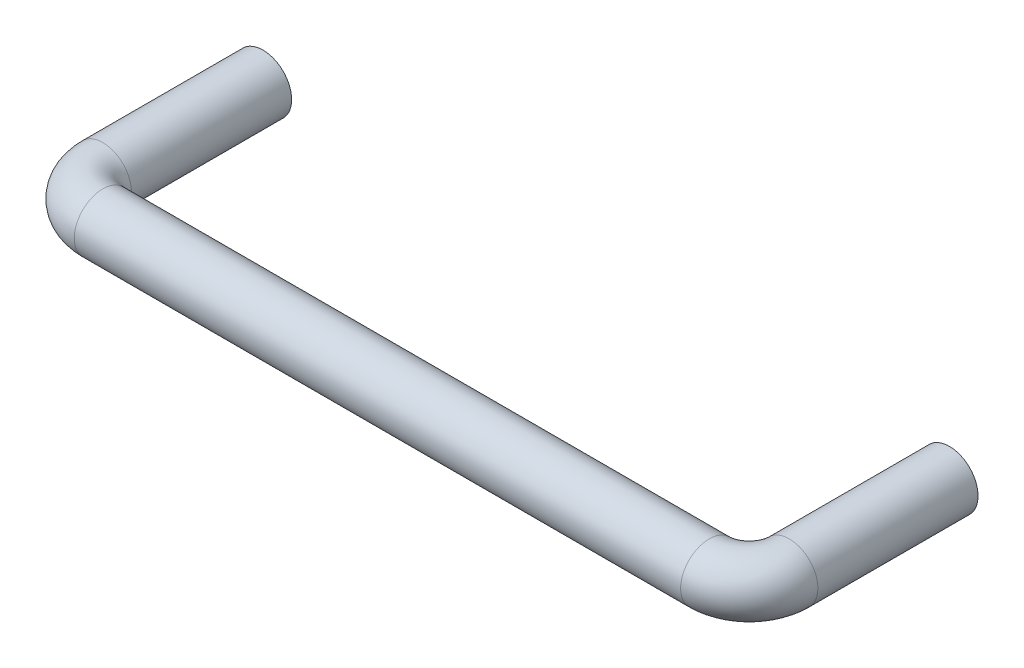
ISO-10303-21;
HEADER;
FILE_DESCRIPTION(('STEP AP214'),'2;1');
FILE_NAME('part.step','',(''),(''),'','','');
FILE_SCHEMA(('AUTOMOTIVE_DESIGN { 1 0 10303 214 1 1 1 1 }'));
ENDSEC;
DATA;
#1=APPLICATION_CONTEXT('core data for automotive mechanical design processes');
#2=APPLICATION_PROTOCOL_DEFINITION('international standard','automotive_design',2000,#1);
#3=PRODUCT_CONTEXT('',#1,'mechanical');
#4=PRODUCT('Part','Part','',(#3));
#5=PRODUCT_RELATED_PRODUCT_CATEGORY('part','',(#4));
#6=PRODUCT_DEFINITION_FORMATION('','',#4);
#7=PRODUCT_DEFINITION_CONTEXT('part definition',#1,'design');
#8=PRODUCT_DEFINITION('design','',#6,#7);
#9=PRODUCT_DEFINITION_SHAPE('','',#8);
#10=(LENGTH_UNIT() NAMED_UNIT(*) SI_UNIT(.MILLI.,.METRE.));
#11=(NAMED_UNIT(*) PLANE_ANGLE_UNIT() SI_UNIT($,.RADIAN.));
#12=(NAMED_UNIT(*) SI_UNIT($,.STERADIAN.) SOLID_ANGLE_UNIT());
#13=UNCERTAINTY_MEASURE_WITH_UNIT(LENGTH_MEASURE(1.E-05),#10,'distance_accuracy_value','');
#14=(GEOMETRIC_REPRESENTATION_CONTEXT(3) GLOBAL_UNCERTAINTY_ASSIGNED_CONTEXT((#13)) GLOBAL_UNIT_ASSIGNED_CONTEXT((#10,
#11,#12)) REPRESENTATION_CONTEXT('',''));
#15=CARTESIAN_POINT('',(0.,0.,0.));
#16=DIRECTION('',(0.,0.,1.));
#17=DIRECTION('',(1.,0.,0.));
#18=AXIS2_PLACEMENT_3D('',#15,#16,#17);
#19=CARTESIAN_POINT('',(0.,0.,0.));
#20=DIRECTION('',(0.,0.,1.));
#21=DIRECTION('',(1.,0.,0.));
#22=AXIS2_PLACEMENT_3D('',#19,#20,#21);
#23=PLANE('',#22);
#24=CARTESIAN_POINT('',(0.,0.,0.));
#25=DIRECTION('',(0.,0.,1.));
#26=DIRECTION('',(1.,0.,0.));
#27=AXIS2_PLACEMENT_3D('',#24,#25,#26);
#28=CIRCLE('',#27,2.95);
#29=CARTESIAN_POINT('',(2.95,0.,0.));
#30=VERTEX_POINT('',#29);
#31=EDGE_CURVE('E23',#30,#30,#28,.T.);
#32=ORIENTED_EDGE('',*,*,#31,.T.);
#33=EDGE_LOOP('',(#32));
#34=FACE_BOUND('',#33,.T.);
#35=CARTESIAN_POINT('',(0.,0.,0.));
#36=DIRECTION('',(0.,0.,1.));
#37=DIRECTION('',(1.,0.,0.));
#38=AXIS2_PLACEMENT_3D('',#35,#36,#37);
#39=CIRCLE('',#38,5.);
#40=CARTESIAN_POINT('',(5.,0.,0.));
#41=VERTEX_POINT('',#40);
#42=EDGE_CURVE('E32',#41,#41,#39,.T.);
#43=ORIENTED_EDGE('',*,*,#42,.F.);
#44=EDGE_LOOP('',(#43));
#45=FACE_BOUND('',#44,.T.);
#46=ADVANCED_FACE('F12',(#34,#45),#23,.F.);
#47=CARTESIAN_POINT('',(120.,0.,1.94289029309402E-13));
#48=DIRECTION('',(0.,0.,-1.));
#49=DIRECTION('',(-1.,0.,0.));
#50=AXIS2_PLACEMENT_3D('',#47,#48,#49);
#51=PLANE('',#50);
#52=CARTESIAN_POINT('',(120.,0.,1.94289029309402E-13));
#53=DIRECTION('',(0.,0.,-1.));
#54=DIRECTION('',(-1.,0.,0.));
#55=AXIS2_PLACEMENT_3D('',#52,#53,#54);
#56=CIRCLE('',#55,2.95000000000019);
#57=CARTESIAN_POINT('',(117.05,0.,1.97213277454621E-13));
#58=VERTEX_POINT('',#57);
#59=EDGE_CURVE('E8',#58,#58,#56,.F.);
#60=ORIENTED_EDGE('',*,*,#59,.T.);
#61=EDGE_LOOP('',(#60));
#62=FACE_BOUND('',#61,.T.);
#63=CARTESIAN_POINT('',(120.,0.,1.94289029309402E-13));
#64=DIRECTION('',(0.,0.,-1.));
#65=DIRECTION('',(-1.,0.,0.));
#66=AXIS2_PLACEMENT_3D('',#63,#64,#65);
#67=CIRCLE('',#66,5.);
#68=CARTESIAN_POINT('',(115.,0.,1.99245382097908E-13));
#69=VERTEX_POINT('',#68);
#70=EDGE_CURVE('E47',#69,#69,#67,.T.);
#71=ORIENTED_EDGE('',*,*,#70,.T.);
#72=EDGE_LOOP('',(#71));
#73=FACE_BOUND('',#72,.T.);
#74=ADVANCED_FACE('F76',(#62,#73),#51,.T.);
#75=CARTESIAN_POINT('',(0.,0.,27.9999999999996));
#76=DIRECTION('',(0.,0.,-1.));
#77=DIRECTION('',(0.,-1.,0.));
#78=AXIS2_PLACEMENT_3D('',#75,#76,#77);
#79=CYLINDRICAL_SURFACE('',#78,5.);
#80=ORIENTED_EDGE('',*,*,#42,.T.);
#81=EDGE_LOOP('',(#80));
#82=FACE_BOUND('',#81,.T.);
#83=CARTESIAN_POINT('',(0.,0.,27.9999999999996));
#84=DIRECTION('',(0.,0.,1.));
#85=DIRECTION('',(1.,0.,0.));
#86=AXIS2_PLACEMENT_3D('',#83,#84,#85);
#87=CIRCLE('',#86,5.);
#88=CARTESIAN_POINT('',(-5.,0.,27.9999999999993));
#89=VERTEX_POINT('',#88);
#90=EDGE_CURVE('E35',#89,#89,#87,.T.);
#91=ORIENTED_EDGE('',*,*,#90,.F.);
#92=EDGE_LOOP('',(#91));
#93=FACE_BOUND('',#92,.T.);
#94=ADVANCED_FACE('F83',(#82,#93),#79,.T.);
#95=CARTESIAN_POINT('',(7.,0.,28.));
#96=DIRECTION('',(0.,-1.,0.));
#97=DIRECTION('',(1.,0.,0.));
#98=AXIS2_PLACEMENT_3D('',#95,#96,#97);
#99=TOROIDAL_SURFACE('',#98,7.,5.);
#100=CARTESIAN_POINT('',(7.,0.,35.));
#101=DIRECTION('',(1.,0.,0.));
#102=DIRECTION('',(0.,0.,-1.));
#103=AXIS2_PLACEMENT_3D('',#100,#101,#102);
#104=CIRCLE('',#103,5.);
#105=CARTESIAN_POINT('',(7.,0.,40.));
#106=VERTEX_POINT('',#105);
#107=EDGE_CURVE('E38',#106,#106,#104,.T.);
#108=CARTESIAN_POINT('',(7.,0.,28.));
#109=DIRECTION('',(0.,-1.,0.));
#110=DIRECTION('',(1.,0.,0.));
#111=AXIS2_PLACEMENT_3D('',#108,#109,#110);
#112=CIRCLE('',#111,12.);
#113=EDGE_CURVE('',#106,#89,#112,.T.);
#114=ORIENTED_EDGE('',*,*,#107,.F.);
#115=ORIENTED_EDGE('',*,*,#90,.T.);
#116=ORIENTED_EDGE('',*,*,#113,.T.);
#117=ORIENTED_EDGE('',*,*,#113,.F.);
#118=EDGE_LOOP('',(#114,#116,#115,#117));
#119=FACE_BOUND('',#118,.T.);
#120=ADVANCED_FACE('F94',(#119),#99,.T.);
#121=CARTESIAN_POINT('',(113.,0.,35.));
#122=DIRECTION('',(-1.,0.,0.));
#123=DIRECTION('',(0.,0.,1.));
#124=AXIS2_PLACEMENT_3D('',#121,#122,#123);
#125=CYLINDRICAL_SURFACE('',#124,5.);
#126=CARTESIAN_POINT('',(113.,0.,35.));
#127=DIRECTION('',(1.,0.,0.));
#128=DIRECTION('',(0.,0.,-1.));
#129=AXIS2_PLACEMENT_3D('',#126,#127,#128);
#130=CIRCLE('',#129,5.);
#131=CARTESIAN_POINT('',(113.,0.,40.));
#132=VERTEX_POINT('',#131);
#133=EDGE_CURVE('E41',#132,#132,#130,.T.);
#134=ORIENTED_EDGE('',*,*,#133,.F.);
#135=EDGE_LOOP('',(#134));
#136=FACE_BOUND('',#135,.T.);
#137=ORIENTED_EDGE('',*,*,#107,.T.);
#138=EDGE_LOOP('',(#137));
#139=FACE_BOUND('',#138,.T.);
#140=ADVANCED_FACE('F90',(#136,#139),#125,.T.);
#141=CARTESIAN_POINT('',(113.,0.,28.));
#142=DIRECTION('',(0.,-1.,0.));
#143=DIRECTION('',(1.,0.,0.));
#144=AXIS2_PLACEMENT_3D('',#141,#142,#143);
#145=TOROIDAL_SURFACE('',#144,7.,5.);
#146=CARTESIAN_POINT('',(120.,0.,28.));
#147=DIRECTION('',(0.,0.,-1.));
#148=DIRECTION('',(-1.,0.,0.));
#149=AXIS2_PLACEMENT_3D('',#146,#147,#148);
#150=CIRCLE('',#149,5.);
#151=CARTESIAN_POINT('',(125.,0.,28.));
#152=VERTEX_POINT('',#151);
#153=EDGE_CURVE('E44',#152,#152,#150,.T.);
#154=CARTESIAN_POINT('',(113.,0.,28.));
#155=DIRECTION('',(0.,-1.,0.));
#156=DIRECTION('',(1.,0.,0.));
#157=AXIS2_PLACEMENT_3D('',#154,#155,#156);
#158=CIRCLE('',#157,12.);
#159=EDGE_CURVE('',#152,#132,#158,.T.);
#160=ORIENTED_EDGE('',*,*,#153,.F.);
#161=ORIENTED_EDGE('',*,*,#133,.T.);
#162=ORIENTED_EDGE('',*,*,#159,.T.);
#163=ORIENTED_EDGE('',*,*,#159,.F.);
#164=EDGE_LOOP('',(#160,#162,#161,#163));
#165=FACE_BOUND('',#164,.T.);
#166=ADVANCED_FACE('F72',(#165),#145,.T.);
#167=CARTESIAN_POINT('',(120.,0.,28.));
#168=DIRECTION('',(0.,0.,-1.));
#169=DIRECTION('',(-1.,0.,0.));
#170=AXIS2_PLACEMENT_3D('',#167,#168,#169);
#171=CYLINDRICAL_SURFACE('',#170,5.);
#172=ORIENTED_EDGE('',*,*,#70,.F.);
#173=EDGE_LOOP('',(#172));
#174=FACE_BOUND('',#173,.T.);
#175=ORIENTED_EDGE('',*,*,#153,.T.);
#176=EDGE_LOOP('',(#175));
#177=FACE_BOUND('',#176,.T.);
#178=ADVANCED_FACE('F61',(#174,#177),#171,.T.);
#179=CARTESIAN_POINT('',(2.5,0.,10.));
#180=DIRECTION('',(0.,0.,-1.));
#181=DIRECTION('',(0.,-1.,0.));
#182=AXIS2_PLACEMENT_3D('',#179,#180,#181);
#183=PLANE('',#182);
#184=CARTESIAN_POINT('',(0.,0.,10.));
#185=DIRECTION('',(0.,0.,1.));
#186=DIRECTION('',(0.,1.,0.));
#187=AXIS2_PLACEMENT_3D('',#184,#185,#186);
#188=CIRCLE('',#187,2.5);
#189=CARTESIAN_POINT('',(0.,2.5,10.));
#190=VERTEX_POINT('',#189);
#191=EDGE_CURVE('E53',#190,#190,#188,.T.);
#192=ORIENTED_EDGE('',*,*,#191,.F.);
#193=EDGE_LOOP('',(#192));
#194=FACE_BOUND('',#193,.T.);
#195=ADVANCED_FACE('F59',(#194),#183,.T.);
#196=CARTESIAN_POINT('',(0.,0.,12.7334656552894));
#197=DIRECTION('',(0.,0.,1.));
#198=DIRECTION('',(0.,1.,0.));
#199=AXIS2_PLACEMENT_3D('',#196,#197,#198);
#200=CYLINDRICAL_SURFACE('',#199,2.5);
#201=CARTESIAN_POINT('',(0.,0.,0.449999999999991));
#202=DIRECTION('',(0.,0.,1.));
#203=DIRECTION('',(1.,0.,0.));
#204=AXIS2_PLACEMENT_3D('',#201,#202,#203);
#205=CIRCLE('',#204,2.5);
#206=CARTESIAN_POINT('',(2.5,0.,0.449999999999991));
#207=VERTEX_POINT('',#206);
#208=EDGE_CURVE('E27',#207,#207,#205,.F.);
#209=ORIENTED_EDGE('',*,*,#208,.T.);
#210=EDGE_LOOP('',(#209));
#211=FACE_BOUND('',#210,.T.);
#212=ORIENTED_EDGE('',*,*,#191,.T.);
#213=EDGE_LOOP('',(#212));
#214=FACE_BOUND('',#213,.T.);
#215=ADVANCED_FACE('F57',(#211,#214),#200,.F.);
#216=CARTESIAN_POINT('',(122.5,0.,10.));
#217=DIRECTION('',(0.,0.,-1.));
#218=DIRECTION('',(-1.,0.,0.));
#219=AXIS2_PLACEMENT_3D('',#216,#217,#218);
#220=PLANE('',#219);
#221=CARTESIAN_POINT('',(120.,0.,10.));
#222=DIRECTION('',(0.,0.,1.));
#223=DIRECTION('',(1.,0.,0.));
#224=AXIS2_PLACEMENT_3D('',#221,#222,#223);
#225=CIRCLE('',#224,2.5);
#226=CARTESIAN_POINT('',(122.5,0.,10.));
#227=VERTEX_POINT('',#226);
#228=EDGE_CURVE('E50',#227,#227,#225,.T.);
#229=ORIENTED_EDGE('',*,*,#228,.F.);
#230=EDGE_LOOP('',(#229));
#231=FACE_BOUND('',#230,.T.);
#232=ADVANCED_FACE('F69',(#231),#220,.T.);
#233=CARTESIAN_POINT('',(120.,0.,14.323326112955));
#234=DIRECTION('',(0.,0.,1.));
#235=DIRECTION('',(1.,0.,0.));
#236=AXIS2_PLACEMENT_3D('',#233,#234,#235);
#237=CYLINDRICAL_SURFACE('',#236,2.5);
#238=CARTESIAN_POINT('',(120.,0.,0.45000000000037));
#239=DIRECTION('',(0.,0.,-1.));
#240=DIRECTION('',(-1.,0.,0.));
#241=AXIS2_PLACEMENT_3D('',#238,#239,#240);
#242=CIRCLE('',#241,2.5);
#243=CARTESIAN_POINT('',(117.5,0.,0.45000000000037));
#244=VERTEX_POINT('',#243);
#245=EDGE_CURVE('E19',#244,#244,#242,.T.);
#246=ORIENTED_EDGE('',*,*,#245,.T.);
#247=EDGE_LOOP('',(#246));
#248=FACE_BOUND('',#247,.T.);
#249=ORIENTED_EDGE('',*,*,#228,.T.);
#250=EDGE_LOOP('',(#249));
#251=FACE_BOUND('',#250,.T.);
#252=ADVANCED_FACE('F103',(#248,#251),#237,.F.);
#253=CARTESIAN_POINT('',(0.,0.,0.449999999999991));
#254=DIRECTION('',(0.,0.,-1.));
#255=DIRECTION('',(-1.,0.,0.));
#256=AXIS2_PLACEMENT_3D('',#253,#254,#255);
#257=CONICAL_SURFACE('',#256,2.5,0.785398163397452);
#258=ORIENTED_EDGE('',*,*,#31,.F.);
#259=EDGE_LOOP('',(#258));
#260=FACE_BOUND('',#259,.T.);
#261=ORIENTED_EDGE('',*,*,#208,.F.);
#262=EDGE_LOOP('',(#261));
#263=FACE_BOUND('',#262,.T.);
#264=ADVANCED_FACE('F101',(#260,#263),#257,.F.);
#265=CARTESIAN_POINT('',(120.,0.,0.450000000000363));
#266=DIRECTION('',(0.,0.,-1.));
#267=DIRECTION('',(-1.,0.,0.));
#268=AXIS2_PLACEMENT_3D('',#265,#266,#267);
#269=CONICAL_SURFACE('',#268,2.5,0.785398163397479);
#270=ORIENTED_EDGE('',*,*,#59,.F.);
#271=EDGE_LOOP('',(#270));
#272=FACE_BOUND('',#271,.T.);
#273=ORIENTED_EDGE('',*,*,#245,.F.);
#274=EDGE_LOOP('',(#273));
#275=FACE_BOUND('',#274,.T.);
#276=ADVANCED_FACE('F14',(#272,#275),#269,.F.);
#277=CLOSED_SHELL('',(#46,#74,#94,#120,#140,#166,#178,#195,#215,#232,#252,#264,#276));
#278=MANIFOLD_SOLID_BREP('B1',#277);
#279=ADVANCED_BREP_SHAPE_REPRESENTATION('',(#18,#278),#14);
#280=SHAPE_DEFINITION_REPRESENTATION(#9,#279);
ENDSEC;
END-ISO-10303-21;
